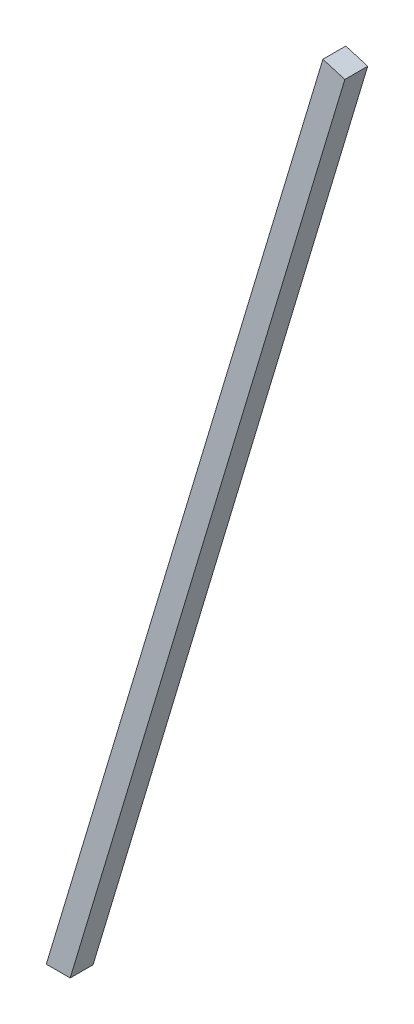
from build123d import *

# Parameters (mm, degrees)
EXTRUSION1_DEPTH = 10


with BuildPart() as part:
    # Esquisse1 → Extrusion1 (new body)
    with BuildSketch(Plane.XY):
        Polygon((0, 0), (-10.440306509, 0), (110.421737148, 402.873478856), (120, 400), align=None)
    extrude(amount=EXTRUSION1_DEPTH)


solid = part.part
